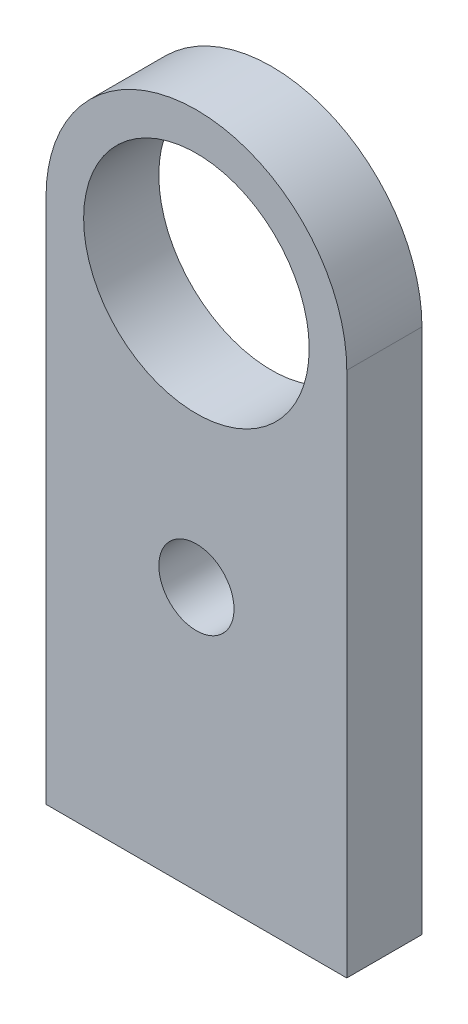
ISO-10303-21;
HEADER;
FILE_DESCRIPTION(('STEP AP214'),'2;1');
FILE_NAME('part.step','',(''),(''),'','','');
FILE_SCHEMA(('AUTOMOTIVE_DESIGN { 1 0 10303 214 1 1 1 1 }'));
ENDSEC;
DATA;
#1=APPLICATION_CONTEXT('core data for automotive mechanical design processes');
#2=APPLICATION_PROTOCOL_DEFINITION('international standard','automotive_design',2000,#1);
#3=PRODUCT_CONTEXT('',#1,'mechanical');
#4=PRODUCT('Part','Part','',(#3));
#5=PRODUCT_RELATED_PRODUCT_CATEGORY('part','',(#4));
#6=PRODUCT_DEFINITION_FORMATION('','',#4);
#7=PRODUCT_DEFINITION_CONTEXT('part definition',#1,'design');
#8=PRODUCT_DEFINITION('design','',#6,#7);
#9=PRODUCT_DEFINITION_SHAPE('','',#8);
#10=(LENGTH_UNIT() NAMED_UNIT(*) SI_UNIT(.MILLI.,.METRE.));
#11=(NAMED_UNIT(*) PLANE_ANGLE_UNIT() SI_UNIT($,.RADIAN.));
#12=(NAMED_UNIT(*) SI_UNIT($,.STERADIAN.) SOLID_ANGLE_UNIT());
#13=UNCERTAINTY_MEASURE_WITH_UNIT(LENGTH_MEASURE(1.E-05),#10,'distance_accuracy_value','');
#14=(GEOMETRIC_REPRESENTATION_CONTEXT(3) GLOBAL_UNCERTAINTY_ASSIGNED_CONTEXT((#13)) GLOBAL_UNIT_ASSIGNED_CONTEXT((#10,
#11,#12)) REPRESENTATION_CONTEXT('',''));
#15=CARTESIAN_POINT('',(0.,0.,0.));
#16=DIRECTION('',(0.,0.,1.));
#17=DIRECTION('',(1.,0.,0.));
#18=AXIS2_PLACEMENT_3D('',#15,#16,#17);
#19=CARTESIAN_POINT('',(0.,0.,6.35));
#20=DIRECTION('',(0.,0.,1.));
#21=DIRECTION('',(1.,0.,0.));
#22=AXIS2_PLACEMENT_3D('',#19,#20,#21);
#23=PLANE('',#22);
#24=CARTESIAN_POINT('',(0.,0.,6.35));
#25=DIRECTION('',(0.,0.,1.));
#26=DIRECTION('',(1.,0.,0.));
#27=AXIS2_PLACEMENT_3D('',#24,#25,#26);
#28=CIRCLE('',#27,9.525);
#29=CARTESIAN_POINT('',(9.525,0.,6.35));
#30=VERTEX_POINT('',#29);
#31=EDGE_CURVE('E100',#30,#30,#28,.T.);
#32=ORIENTED_EDGE('',*,*,#31,.F.);
#33=EDGE_LOOP('',(#32));
#34=FACE_BOUND('',#33,.T.);
#35=DIRECTION('',(1.,0.,0.));
#36=VECTOR('',#35,1.);
#37=CARTESIAN_POINT('',(12.7,-44.45,6.35));
#38=LINE('',#37,#36);
#39=CARTESIAN_POINT('',(-12.7,-44.45,6.35));
#40=VERTEX_POINT('',#39);
#41=CARTESIAN_POINT('',(12.7,-44.45,6.35));
#42=VERTEX_POINT('',#41);
#43=EDGE_CURVE('E85',#40,#42,#38,.T.);
#44=ORIENTED_EDGE('',*,*,#43,.T.);
#45=DIRECTION('',(0.,1.,0.));
#46=VECTOR('',#45,1.);
#47=CARTESIAN_POINT('',(12.7,0.,6.35));
#48=LINE('',#47,#46);
#49=CARTESIAN_POINT('',(12.7,0.,6.35));
#50=VERTEX_POINT('',#49);
#51=EDGE_CURVE('E80',#42,#50,#48,.T.);
#52=ORIENTED_EDGE('',*,*,#51,.T.);
#53=CARTESIAN_POINT('',(0.,0.,6.35));
#54=DIRECTION('',(0.,0.,1.));
#55=DIRECTION('',(1.,0.,0.));
#56=AXIS2_PLACEMENT_3D('',#53,#54,#55);
#57=CIRCLE('',#56,12.7);
#58=CARTESIAN_POINT('',(-12.7,0.,6.35));
#59=VERTEX_POINT('',#58);
#60=EDGE_CURVE('E83',#50,#59,#57,.T.);
#61=ORIENTED_EDGE('',*,*,#60,.T.);
#62=DIRECTION('',(0.,-1.,0.));
#63=VECTOR('',#62,1.);
#64=CARTESIAN_POINT('',(-12.7,-44.45,6.35));
#65=LINE('',#64,#63);
#66=EDGE_CURVE('E50',#59,#40,#65,.T.);
#67=ORIENTED_EDGE('',*,*,#66,.T.);
#68=EDGE_LOOP('',(#44,#52,#61,#67));
#69=FACE_BOUND('',#68,.T.);
#70=CARTESIAN_POINT('',(0.,-22.225,6.35));
#71=DIRECTION('',(0.,0.,1.));
#72=DIRECTION('',(1.,0.,0.));
#73=AXIS2_PLACEMENT_3D('',#70,#71,#72);
#74=CIRCLE('',#73,3.175);
#75=CARTESIAN_POINT('',(3.175,-22.225,6.35));
#76=VERTEX_POINT('',#75);
#77=EDGE_CURVE('E115',#76,#76,#74,.T.);
#78=ORIENTED_EDGE('',*,*,#77,.F.);
#79=EDGE_LOOP('',(#78));
#80=FACE_BOUND('',#79,.T.);
#81=ADVANCED_FACE('F33',(#34,#69,#80),#23,.T.);
#82=CARTESIAN_POINT('',(0.,0.,0.));
#83=DIRECTION('',(0.,0.,1.));
#84=DIRECTION('',(1.,0.,0.));
#85=AXIS2_PLACEMENT_3D('',#82,#83,#84);
#86=PLANE('',#85);
#87=CARTESIAN_POINT('',(0.,0.,0.));
#88=DIRECTION('',(0.,0.,1.));
#89=DIRECTION('',(1.,0.,0.));
#90=AXIS2_PLACEMENT_3D('',#87,#88,#89);
#91=CIRCLE('',#90,9.525);
#92=CARTESIAN_POINT('',(9.525,0.,0.));
#93=VERTEX_POINT('',#92);
#94=EDGE_CURVE('E112',#93,#93,#91,.T.);
#95=ORIENTED_EDGE('',*,*,#94,.T.);
#96=EDGE_LOOP('',(#95));
#97=FACE_BOUND('',#96,.T.);
#98=DIRECTION('',(1.,0.,0.));
#99=VECTOR('',#98,1.);
#100=CARTESIAN_POINT('',(12.7,-44.45,0.));
#101=LINE('',#100,#99);
#102=CARTESIAN_POINT('',(-12.7,-44.45,0.));
#103=VERTEX_POINT('',#102);
#104=CARTESIAN_POINT('',(12.7,-44.45,0.));
#105=VERTEX_POINT('',#104);
#106=EDGE_CURVE('E97',#103,#105,#101,.T.);
#107=ORIENTED_EDGE('',*,*,#106,.F.);
#108=DIRECTION('',(0.,-1.,0.));
#109=VECTOR('',#108,1.);
#110=CARTESIAN_POINT('',(-12.7,-44.45,0.));
#111=LINE('',#110,#109);
#112=CARTESIAN_POINT('',(-12.7,0.,0.));
#113=VERTEX_POINT('',#112);
#114=EDGE_CURVE('E73',#113,#103,#111,.T.);
#115=ORIENTED_EDGE('',*,*,#114,.F.);
#116=CARTESIAN_POINT('',(0.,0.,0.));
#117=DIRECTION('',(0.,0.,1.));
#118=DIRECTION('',(1.,0.,0.));
#119=AXIS2_PLACEMENT_3D('',#116,#117,#118);
#120=CIRCLE('',#119,12.7);
#121=CARTESIAN_POINT('',(12.7,0.,0.));
#122=VERTEX_POINT('',#121);
#123=EDGE_CURVE('E67',#122,#113,#120,.T.);
#124=ORIENTED_EDGE('',*,*,#123,.F.);
#125=DIRECTION('',(0.,1.,0.));
#126=VECTOR('',#125,1.);
#127=CARTESIAN_POINT('',(12.7,0.,0.));
#128=LINE('',#127,#126);
#129=EDGE_CURVE('E89',#105,#122,#128,.T.);
#130=ORIENTED_EDGE('',*,*,#129,.F.);
#131=EDGE_LOOP('',(#107,#115,#124,#130));
#132=FACE_BOUND('',#131,.T.);
#133=CARTESIAN_POINT('',(0.,-22.225,0.));
#134=DIRECTION('',(0.,0.,1.));
#135=DIRECTION('',(1.,0.,0.));
#136=AXIS2_PLACEMENT_3D('',#133,#134,#135);
#137=CIRCLE('',#136,3.175);
#138=CARTESIAN_POINT('',(3.175,-22.225,0.));
#139=VERTEX_POINT('',#138);
#140=EDGE_CURVE('E118',#139,#139,#137,.T.);
#141=ORIENTED_EDGE('',*,*,#140,.T.);
#142=EDGE_LOOP('',(#141));
#143=FACE_BOUND('',#142,.T.);
#144=ADVANCED_FACE('F108',(#97,#132,#143),#86,.F.);
#145=CARTESIAN_POINT('',(12.7,-44.45,6.35));
#146=DIRECTION('',(0.,1.,0.));
#147=DIRECTION('',(0.,0.,1.));
#148=AXIS2_PLACEMENT_3D('',#145,#146,#147);
#149=PLANE('',#148);
#150=ORIENTED_EDGE('',*,*,#106,.T.);
#151=DIRECTION('',(0.,0.,-1.));
#152=VECTOR('',#151,1.);
#153=CARTESIAN_POINT('',(12.7,-44.45,6.35));
#154=LINE('',#153,#152);
#155=EDGE_CURVE('E11',#42,#105,#154,.T.);
#156=ORIENTED_EDGE('',*,*,#155,.F.);
#157=ORIENTED_EDGE('',*,*,#43,.F.);
#158=DIRECTION('',(0.,0.,-1.));
#159=VECTOR('',#158,1.);
#160=CARTESIAN_POINT('',(-12.7,-44.45,6.35));
#161=LINE('',#160,#159);
#162=EDGE_CURVE('E93',#40,#103,#161,.T.);
#163=ORIENTED_EDGE('',*,*,#162,.T.);
#164=EDGE_LOOP('',(#150,#156,#157,#163));
#165=FACE_BOUND('',#164,.T.);
#166=ADVANCED_FACE('F35',(#165),#149,.F.);
#167=CARTESIAN_POINT('',(12.7,0.,6.35));
#168=DIRECTION('',(-1.,0.,0.));
#169=DIRECTION('',(0.,0.,1.));
#170=AXIS2_PLACEMENT_3D('',#167,#168,#169);
#171=PLANE('',#170);
#172=ORIENTED_EDGE('',*,*,#129,.T.);
#173=DIRECTION('',(0.,0.,-1.));
#174=VECTOR('',#173,1.);
#175=CARTESIAN_POINT('',(12.7,0.,6.35));
#176=LINE('',#175,#174);
#177=EDGE_CURVE('E42',#50,#122,#176,.T.);
#178=ORIENTED_EDGE('',*,*,#177,.F.);
#179=ORIENTED_EDGE('',*,*,#51,.F.);
#180=ORIENTED_EDGE('',*,*,#155,.T.);
#181=EDGE_LOOP('',(#172,#178,#179,#180));
#182=FACE_BOUND('',#181,.T.);
#183=ADVANCED_FACE('F88',(#182),#171,.F.);
#184=CARTESIAN_POINT('',(0.,0.,6.35));
#185=DIRECTION('',(0.,0.,-1.));
#186=DIRECTION('',(-1.,0.,0.));
#187=AXIS2_PLACEMENT_3D('',#184,#185,#186);
#188=CYLINDRICAL_SURFACE('',#187,12.7);
#189=ORIENTED_EDGE('',*,*,#123,.T.);
#190=DIRECTION('',(0.,0.,-1.));
#191=VECTOR('',#190,1.);
#192=CARTESIAN_POINT('',(-12.7,0.,6.35));
#193=LINE('',#192,#191);
#194=EDGE_CURVE('E90',#59,#113,#193,.T.);
#195=ORIENTED_EDGE('',*,*,#194,.F.);
#196=ORIENTED_EDGE('',*,*,#60,.F.);
#197=ORIENTED_EDGE('',*,*,#177,.T.);
#198=EDGE_LOOP('',(#189,#195,#196,#197));
#199=FACE_BOUND('',#198,.T.);
#200=ADVANCED_FACE('F91',(#199),#188,.T.);
#201=CARTESIAN_POINT('',(-12.7,-44.45,6.35));
#202=DIRECTION('',(1.,0.,0.));
#203=DIRECTION('',(0.,0.,-1.));
#204=AXIS2_PLACEMENT_3D('',#201,#202,#203);
#205=PLANE('',#204);
#206=ORIENTED_EDGE('',*,*,#114,.T.);
#207=ORIENTED_EDGE('',*,*,#162,.F.);
#208=ORIENTED_EDGE('',*,*,#66,.F.);
#209=ORIENTED_EDGE('',*,*,#194,.T.);
#210=EDGE_LOOP('',(#206,#207,#208,#209));
#211=FACE_BOUND('',#210,.T.);
#212=ADVANCED_FACE('F105',(#211),#205,.F.);
#213=CARTESIAN_POINT('',(0.,0.,6.35));
#214=DIRECTION('',(0.,0.,-1.));
#215=DIRECTION('',(-1.,0.,0.));
#216=AXIS2_PLACEMENT_3D('',#213,#214,#215);
#217=CYLINDRICAL_SURFACE('',#216,9.525);
#218=ORIENTED_EDGE('',*,*,#31,.T.);
#219=EDGE_LOOP('',(#218));
#220=FACE_BOUND('',#219,.T.);
#221=ORIENTED_EDGE('',*,*,#94,.F.);
#222=EDGE_LOOP('',(#221));
#223=FACE_BOUND('',#222,.T.);
#224=ADVANCED_FACE('F136',(#220,#223),#217,.F.);
#225=CARTESIAN_POINT('',(0.,-22.225,6.35));
#226=DIRECTION('',(0.,0.,-1.));
#227=DIRECTION('',(-1.,0.,0.));
#228=AXIS2_PLACEMENT_3D('',#225,#226,#227);
#229=CYLINDRICAL_SURFACE('',#228,3.175);
#230=ORIENTED_EDGE('',*,*,#77,.T.);
#231=EDGE_LOOP('',(#230));
#232=FACE_BOUND('',#231,.T.);
#233=ORIENTED_EDGE('',*,*,#140,.F.);
#234=EDGE_LOOP('',(#233));
#235=FACE_BOUND('',#234,.T.);
#236=ADVANCED_FACE('F124',(#232,#235),#229,.F.);
#237=CLOSED_SHELL('',(#81,#144,#166,#183,#200,#212,#224,#236));
#238=MANIFOLD_SOLID_BREP('B2',#237);
#239=ADVANCED_BREP_SHAPE_REPRESENTATION('',(#18,#238),#14);
#240=SHAPE_DEFINITION_REPRESENTATION(#9,#239);
ENDSEC;
END-ISO-10303-21;
